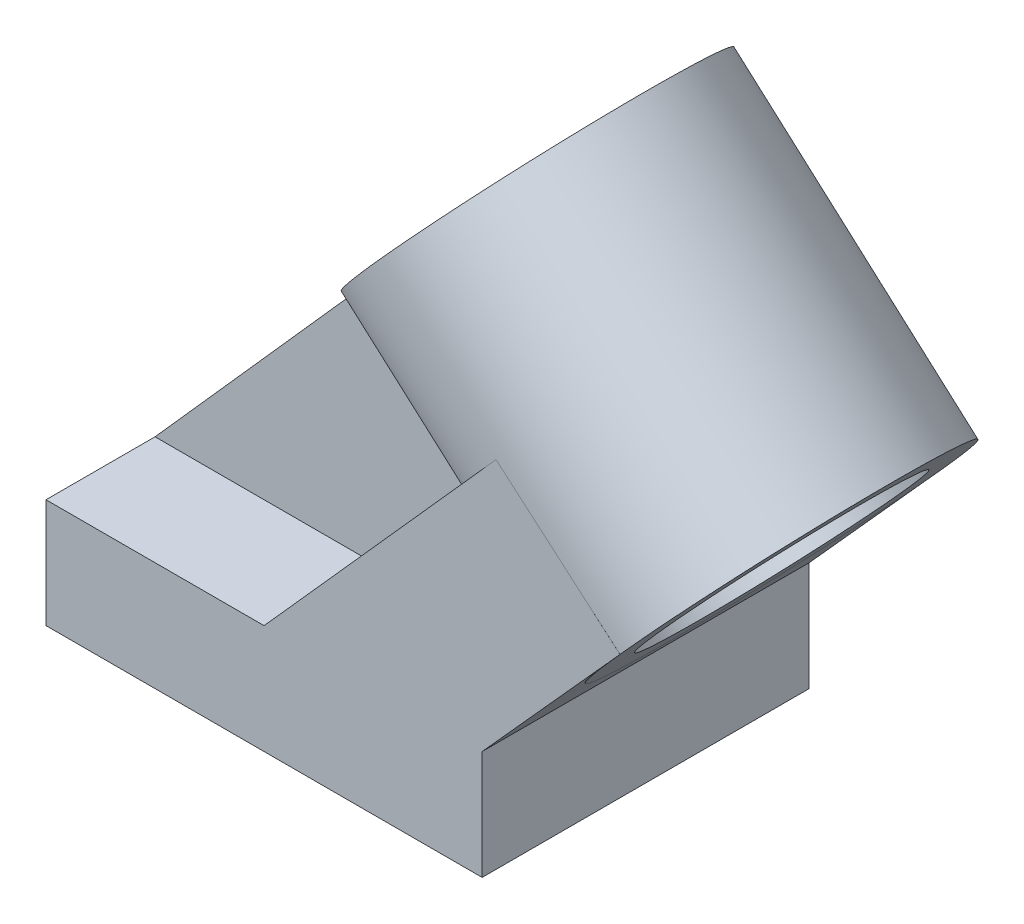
ISO-10303-21;
HEADER;
FILE_DESCRIPTION(('STEP AP214'),'2;1');
FILE_NAME('part.step','',(''),(''),'','','');
FILE_SCHEMA(('AUTOMOTIVE_DESIGN { 1 0 10303 214 1 1 1 1 }'));
ENDSEC;
DATA;
#1=APPLICATION_CONTEXT('core data for automotive mechanical design processes');
#2=APPLICATION_PROTOCOL_DEFINITION('international standard','automotive_design',2000,#1);
#3=PRODUCT_CONTEXT('',#1,'mechanical');
#4=PRODUCT('Part','Part','',(#3));
#5=PRODUCT_RELATED_PRODUCT_CATEGORY('part','',(#4));
#6=PRODUCT_DEFINITION_FORMATION('','',#4);
#7=PRODUCT_DEFINITION_CONTEXT('part definition',#1,'design');
#8=PRODUCT_DEFINITION('design','',#6,#7);
#9=PRODUCT_DEFINITION_SHAPE('','',#8);
#10=(LENGTH_UNIT() NAMED_UNIT(*) SI_UNIT(.MILLI.,.METRE.));
#11=(NAMED_UNIT(*) PLANE_ANGLE_UNIT() SI_UNIT($,.RADIAN.));
#12=(NAMED_UNIT(*) SI_UNIT($,.STERADIAN.) SOLID_ANGLE_UNIT());
#13=UNCERTAINTY_MEASURE_WITH_UNIT(LENGTH_MEASURE(1.E-05),#10,'distance_accuracy_value','');
#14=(GEOMETRIC_REPRESENTATION_CONTEXT(3) GLOBAL_UNCERTAINTY_ASSIGNED_CONTEXT((#13)) GLOBAL_UNIT_ASSIGNED_CONTEXT((#10,
#11,#12)) REPRESENTATION_CONTEXT('',''));
#15=CARTESIAN_POINT('',(0.,0.,0.));
#16=DIRECTION('',(0.,0.,1.));
#17=DIRECTION('',(1.,0.,0.));
#18=AXIS2_PLACEMENT_3D('',#15,#16,#17);
#19=CARTESIAN_POINT('',(-50.8,0.,76.2));
#20=DIRECTION('',(0.,-1.,0.));
#21=DIRECTION('',(0.,0.,-1.));
#22=AXIS2_PLACEMENT_3D('',#19,#20,#21);
#23=PLANE('',#22);
#24=DIRECTION('',(-1.,0.,0.));
#25=VECTOR('',#24,1.);
#26=CARTESIAN_POINT('',(-50.8,0.,25.4));
#27=LINE('',#26,#25);
#28=CARTESIAN_POINT('',(0.,0.,25.4));
#29=VERTEX_POINT('',#28);
#30=CARTESIAN_POINT('',(-50.8,0.,25.4));
#31=VERTEX_POINT('',#30);
#32=EDGE_CURVE('E129',#29,#31,#27,.T.);
#33=ORIENTED_EDGE('',*,*,#32,.F.);
#34=DIRECTION('',(0.,0.,1.));
#35=VECTOR('',#34,1.);
#36=CARTESIAN_POINT('',(0.,0.,0.));
#37=LINE('',#36,#35);
#38=CARTESIAN_POINT('',(0.,0.,0.));
#39=VERTEX_POINT('',#38);
#40=EDGE_CURVE('E206',#39,#29,#37,.T.);
#41=ORIENTED_EDGE('',*,*,#40,.F.);
#42=DIRECTION('',(-1.,0.,0.));
#43=VECTOR('',#42,1.);
#44=CARTESIAN_POINT('',(-50.8,0.,0.));
#45=LINE('',#44,#43);
#46=CARTESIAN_POINT('',(-50.8,0.,0.));
#47=VERTEX_POINT('',#46);
#48=EDGE_CURVE('E151',#39,#47,#45,.T.);
#49=ORIENTED_EDGE('',*,*,#48,.T.);
#50=DIRECTION('',(0.,0.,-1.));
#51=VECTOR('',#50,1.);
#52=CARTESIAN_POINT('',(-50.8,0.,76.2));
#53=LINE('',#52,#51);
#54=EDGE_CURVE('E149',#31,#47,#53,.T.);
#55=ORIENTED_EDGE('',*,*,#54,.F.);
#56=EDGE_LOOP('',(#33,#41,#49,#55));
#57=FACE_BOUND('',#56,.T.);
#58=ADVANCED_FACE('F33',(#57),#23,.F.);
#59=CARTESIAN_POINT('',(0.,0.,0.));
#60=DIRECTION('',(0.745935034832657,-0.666018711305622,0.));
#61=DIRECTION('',(0.666018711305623,0.745935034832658,0.));
#62=AXIS2_PLACEMENT_3D('',#59,#60,#61);
#63=PLANE('',#62);
#64=DIRECTION('',(-0.666018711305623,-0.745935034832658,0.));
#65=VECTOR('',#64,1.);
#66=CARTESIAN_POINT('',(0.,0.,25.4));
#67=LINE('',#66,#65);
#68=CARTESIAN_POINT('',(30.1166733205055,33.7304063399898,25.4));
#69=VERTEX_POINT('',#68);
#70=EDGE_CURVE('E132',#69,#29,#67,.T.);
#71=ORIENTED_EDGE('',*,*,#70,.F.);
#72=CARTESIAN_POINT('',(54.0407477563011,60.5251569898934,38.1));
#73=DIRECTION('',(0.745935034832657,-0.666018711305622,0.));
#74=DIRECTION('',(0.666018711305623,0.745935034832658,0.));
#75=AXIS2_PLACEMENT_3D('',#72,#73,#74);
#76=CIRCLE('',#75,38.1);
#77=CARTESIAN_POINT('',(54.0407477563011,60.5251569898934,0.));
#78=VERTEX_POINT('',#77);
#79=EDGE_CURVE('E185',#69,#78,#76,.T.);
#80=ORIENTED_EDGE('',*,*,#79,.T.);
#81=DIRECTION('',(0.666018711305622,0.745935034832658,0.));
#82=VECTOR('',#81,1.);
#83=CARTESIAN_POINT('',(0.,0.,0.));
#84=LINE('',#83,#82);
#85=EDGE_CURVE('E190',#39,#78,#84,.T.);
#86=ORIENTED_EDGE('',*,*,#85,.F.);
#87=ORIENTED_EDGE('',*,*,#40,.T.);
#88=EDGE_LOOP('',(#71,#80,#86,#87));
#89=FACE_BOUND('',#88,.T.);
#90=ADVANCED_FACE('F264',(#89),#63,.F.);
#91=CARTESIAN_POINT('',(54.0407477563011,60.5251569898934,0.));
#92=DIRECTION('',(-0.652720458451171,-0.75759884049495,0.));
#93=DIRECTION('',(0.75759884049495,-0.652720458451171,0.));
#94=AXIS2_PLACEMENT_3D('',#91,#92,#93);
#95=PLANE('',#94);
#96=DIRECTION('',(0.75759884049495,-0.652720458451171,0.));
#97=VECTOR('',#96,1.);
#98=CARTESIAN_POINT('',(54.0407477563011,60.5251569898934,0.));
#99=LINE('',#98,#97);
#100=CARTESIAN_POINT('',(82.9052635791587,35.6565075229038,0.));
#101=VERTEX_POINT('',#100);
#102=EDGE_CURVE('E186',#78,#101,#99,.T.);
#103=ORIENTED_EDGE('',*,*,#102,.F.);
#104=CARTESIAN_POINT('',(54.040747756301,60.5251569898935,38.1));
#105=DIRECTION('',(-0.652720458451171,-0.75759884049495,0.));
#106=DIRECTION('',(-0.75759884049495,0.652720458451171,0.));
#107=AXIS2_PLACEMENT_3D('',#104,#105,#106);
#108=ELLIPSE('',#107,2154.00934788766,38.1);
#109=CARTESIAN_POINT('',(82.9052635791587,35.6565075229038,0.00596051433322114));
#110=VERTEX_POINT('',#109);
#111=EDGE_CURVE('E180',#78,#110,#108,.T.);
#112=ORIENTED_EDGE('',*,*,#111,.T.);
#113=DIRECTION('',(0.,0.,1.));
#114=VECTOR('',#113,1.);
#115=CARTESIAN_POINT('',(82.9052635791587,35.6565075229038,0.));
#116=LINE('',#115,#114);
#117=EDGE_CURVE('E202',#101,#110,#116,.T.);
#118=ORIENTED_EDGE('',*,*,#117,.F.);
#119=EDGE_LOOP('',(#103,#112,#118));
#120=FACE_BOUND('',#119,.T.);
#121=ADVANCED_FACE('F265',(#120),#95,.F.);
#122=CARTESIAN_POINT('',(50.8,0.,0.));
#123=DIRECTION('',(0.743144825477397,-0.669130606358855,0.));
#124=DIRECTION('',(0.669130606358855,0.743144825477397,0.));
#125=AXIS2_PLACEMENT_3D('',#122,#123,#124);
#126=PLANE('',#125);
#127=CARTESIAN_POINT('',(82.4543253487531,35.1556898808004,38.1));
#128=DIRECTION('',(0.743144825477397,-0.669130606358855,0.));
#129=DIRECTION('',(-0.669130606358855,-0.743144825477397,0.));
#130=AXIS2_PLACEMENT_3D('',#127,#128,#129);
#131=ELLIPSE('',#130,38.100332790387,38.1);
#132=CARTESIAN_POINT('',(82.4543253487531,35.1556898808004,0.));
#133=VERTEX_POINT('',#132);
#134=EDGE_CURVE('E11',#133,#110,#131,.T.);
#135=ORIENTED_EDGE('',*,*,#134,.F.);
#136=DIRECTION('',(0.669130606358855,0.743144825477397,0.));
#137=VECTOR('',#136,1.);
#138=CARTESIAN_POINT('',(50.8,0.,0.));
#139=LINE('',#138,#137);
#140=EDGE_CURVE('E189',#133,#101,#139,.T.);
#141=ORIENTED_EDGE('',*,*,#140,.T.);
#142=ORIENTED_EDGE('',*,*,#117,.T.);
#143=EDGE_LOOP('',(#135,#141,#142));
#144=FACE_BOUND('',#143,.T.);
#145=ADVANCED_FACE('F256',(#144),#126,.T.);
#146=CARTESIAN_POINT('',(82.9052635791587,35.6565075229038,76.1940394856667));
#147=VERTEX_POINT('',#146);
#148=CARTESIAN_POINT('',(82.4543253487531,35.1556898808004,76.2));
#149=VERTEX_POINT('',#148);
#150=EDGE_CURVE('E43',#147,#149,#131,.T.);
#151=ORIENTED_EDGE('',*,*,#150,.F.);
#152=CARTESIAN_POINT('',(82.9052635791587,35.6565075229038,76.2));
#153=VERTEX_POINT('',#152);
#154=EDGE_CURVE('E209',#147,#153,#116,.T.);
#155=ORIENTED_EDGE('',*,*,#154,.T.);
#156=DIRECTION('',(0.669130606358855,0.743144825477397,0.));
#157=VECTOR('',#156,1.);
#158=CARTESIAN_POINT('',(50.8,0.,76.2));
#159=LINE('',#158,#157);
#160=EDGE_CURVE('E197',#149,#153,#159,.T.);
#161=ORIENTED_EDGE('',*,*,#160,.F.);
#162=EDGE_LOOP('',(#151,#155,#161));
#163=FACE_BOUND('',#162,.T.);
#164=ADVANCED_FACE('F318',(#163),#126,.T.);
#165=CARTESIAN_POINT('',(0.,0.,50.8));
#166=VERTEX_POINT('',#165);
#167=CARTESIAN_POINT('',(0.,0.,76.2));
#168=VERTEX_POINT('',#167);
#169=EDGE_CURVE('E37',#166,#168,#37,.T.);
#170=ORIENTED_EDGE('',*,*,#169,.F.);
#171=DIRECTION('',(-1.,0.,0.));
#172=VECTOR('',#171,1.);
#173=CARTESIAN_POINT('',(-50.8,0.,50.8));
#174=LINE('',#173,#172);
#175=CARTESIAN_POINT('',(-50.8,0.,50.8));
#176=VERTEX_POINT('',#175);
#177=EDGE_CURVE('E283',#166,#176,#174,.T.);
#178=ORIENTED_EDGE('',*,*,#177,.T.);
#179=CARTESIAN_POINT('',(-50.8,0.,76.2));
#180=VERTEX_POINT('',#179);
#181=EDGE_CURVE('E155',#180,#176,#53,.T.);
#182=ORIENTED_EDGE('',*,*,#181,.F.);
#183=DIRECTION('',(-1.,0.,0.));
#184=VECTOR('',#183,1.);
#185=CARTESIAN_POINT('',(-50.8,0.,76.2));
#186=LINE('',#185,#184);
#187=EDGE_CURVE('E156',#168,#180,#186,.T.);
#188=ORIENTED_EDGE('',*,*,#187,.F.);
#189=EDGE_LOOP('',(#170,#178,#182,#188));
#190=FACE_BOUND('',#189,.T.);
#191=ADVANCED_FACE('F282',(#190),#23,.F.);
#192=CARTESIAN_POINT('',(-50.8,-25.4,76.2));
#193=DIRECTION('',(1.,0.,0.));
#194=DIRECTION('',(0.,0.,-1.));
#195=AXIS2_PLACEMENT_3D('',#192,#193,#194);
#196=PLANE('',#195);
#197=ORIENTED_EDGE('',*,*,#181,.T.);
#198=DIRECTION('',(0.,0.,-1.));
#199=VECTOR('',#198,1.);
#200=CARTESIAN_POINT('',(-50.8,0.,76.2));
#201=LINE('',#200,#199);
#202=EDGE_CURVE('E142',#31,#176,#201,.F.);
#203=ORIENTED_EDGE('',*,*,#202,.F.);
#204=ORIENTED_EDGE('',*,*,#54,.T.);
#205=DIRECTION('',(0.,-1.,0.));
#206=VECTOR('',#205,1.);
#207=CARTESIAN_POINT('',(-50.8,-25.4,0.));
#208=LINE('',#207,#206);
#209=CARTESIAN_POINT('',(-50.8,-25.4,0.));
#210=VERTEX_POINT('',#209);
#211=EDGE_CURVE('E266',#47,#210,#208,.T.);
#212=ORIENTED_EDGE('',*,*,#211,.T.);
#213=DIRECTION('',(0.,0.,-1.));
#214=VECTOR('',#213,1.);
#215=CARTESIAN_POINT('',(-50.8,-25.4,76.2));
#216=LINE('',#215,#214);
#217=CARTESIAN_POINT('',(-50.8,-25.4,76.2));
#218=VERTEX_POINT('',#217);
#219=EDGE_CURVE('E219',#218,#210,#216,.T.);
#220=ORIENTED_EDGE('',*,*,#219,.F.);
#221=DIRECTION('',(0.,-1.,0.));
#222=VECTOR('',#221,1.);
#223=CARTESIAN_POINT('',(-50.8,-25.4,76.2));
#224=LINE('',#223,#222);
#225=EDGE_CURVE('E231',#180,#218,#224,.T.);
#226=ORIENTED_EDGE('',*,*,#225,.F.);
#227=EDGE_LOOP('',(#197,#203,#204,#212,#220,#226));
#228=FACE_BOUND('',#227,.T.);
#229=ADVANCED_FACE('F35',(#228),#196,.F.);
#230=CARTESIAN_POINT('',(50.8,-25.4,76.2));
#231=DIRECTION('',(0.,1.,0.));
#232=DIRECTION('',(-1.,0.,0.));
#233=AXIS2_PLACEMENT_3D('',#230,#231,#232);
#234=PLANE('',#233);
#235=ORIENTED_EDGE('',*,*,#219,.T.);
#236=DIRECTION('',(1.,0.,0.));
#237=VECTOR('',#236,1.);
#238=CARTESIAN_POINT('',(50.8,-25.4,0.));
#239=LINE('',#238,#237);
#240=CARTESIAN_POINT('',(50.8,-25.4,0.));
#241=VERTEX_POINT('',#240);
#242=EDGE_CURVE('E249',#210,#241,#239,.T.);
#243=ORIENTED_EDGE('',*,*,#242,.T.);
#244=DIRECTION('',(0.,0.,-1.));
#245=VECTOR('',#244,1.);
#246=CARTESIAN_POINT('',(50.8,-25.4,76.2));
#247=LINE('',#246,#245);
#248=CARTESIAN_POINT('',(50.8,-25.4,76.2));
#249=VERTEX_POINT('',#248);
#250=EDGE_CURVE('E221',#249,#241,#247,.T.);
#251=ORIENTED_EDGE('',*,*,#250,.F.);
#252=DIRECTION('',(1.,0.,0.));
#253=VECTOR('',#252,1.);
#254=CARTESIAN_POINT('',(50.8,-25.4,76.2));
#255=LINE('',#254,#253);
#256=EDGE_CURVE('E272',#218,#249,#255,.T.);
#257=ORIENTED_EDGE('',*,*,#256,.F.);
#258=EDGE_LOOP('',(#235,#243,#251,#257));
#259=FACE_BOUND('',#258,.T.);
#260=ADVANCED_FACE('F322',(#259),#234,.F.);
#261=CARTESIAN_POINT('',(50.8,0.,76.2));
#262=DIRECTION('',(-1.,0.,0.));
#263=DIRECTION('',(0.,0.,1.));
#264=AXIS2_PLACEMENT_3D('',#261,#262,#263);
#265=PLANE('',#264);
#266=ORIENTED_EDGE('',*,*,#250,.T.);
#267=DIRECTION('',(0.,1.,0.));
#268=VECTOR('',#267,1.);
#269=CARTESIAN_POINT('',(50.8,0.,0.));
#270=LINE('',#269,#268);
#271=CARTESIAN_POINT('',(50.8,0.,0.));
#272=VERTEX_POINT('',#271);
#273=EDGE_CURVE('E232',#241,#272,#270,.T.);
#274=ORIENTED_EDGE('',*,*,#273,.T.);
#275=DIRECTION('',(0.,0.,-1.));
#276=VECTOR('',#275,1.);
#277=CARTESIAN_POINT('',(50.8,0.,76.2));
#278=LINE('',#277,#276);
#279=CARTESIAN_POINT('',(50.8,0.,76.2));
#280=VERTEX_POINT('',#279);
#281=EDGE_CURVE('E227',#280,#272,#278,.T.);
#282=ORIENTED_EDGE('',*,*,#281,.F.);
#283=DIRECTION('',(0.,1.,0.));
#284=VECTOR('',#283,1.);
#285=CARTESIAN_POINT('',(50.8,0.,76.2));
#286=LINE('',#285,#284);
#287=EDGE_CURVE('E270',#249,#280,#286,.T.);
#288=ORIENTED_EDGE('',*,*,#287,.F.);
#289=EDGE_LOOP('',(#266,#274,#282,#288));
#290=FACE_BOUND('',#289,.T.);
#291=ADVANCED_FACE('F246',(#290),#265,.F.);
#292=CARTESIAN_POINT('',(0.,0.,76.2));
#293=DIRECTION('',(0.,0.,-1.));
#294=DIRECTION('',(-1.,0.,0.));
#295=AXIS2_PLACEMENT_3D('',#292,#293,#294);
#296=PLANE('',#295);
#297=EDGE_CURVE('E198',#280,#149,#159,.T.);
#298=ORIENTED_EDGE('',*,*,#297,.T.);
#299=ORIENTED_EDGE('',*,*,#160,.T.);
#300=DIRECTION('',(0.75759884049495,-0.652720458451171,0.));
#301=VECTOR('',#300,1.);
#302=CARTESIAN_POINT('',(54.0407477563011,60.5251569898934,76.2));
#303=LINE('',#302,#301);
#304=CARTESIAN_POINT('',(54.0407477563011,60.5251569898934,76.2));
#305=VERTEX_POINT('',#304);
#306=EDGE_CURVE('E194',#305,#153,#303,.T.);
#307=ORIENTED_EDGE('',*,*,#306,.F.);
#308=DIRECTION('',(0.666018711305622,0.745935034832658,0.));
#309=VECTOR('',#308,1.);
#310=CARTESIAN_POINT('',(0.,0.,76.2));
#311=LINE('',#310,#309);
#312=EDGE_CURVE('E184',#168,#305,#311,.T.);
#313=ORIENTED_EDGE('',*,*,#312,.F.);
#314=ORIENTED_EDGE('',*,*,#187,.T.);
#315=ORIENTED_EDGE('',*,*,#225,.T.);
#316=ORIENTED_EDGE('',*,*,#256,.T.);
#317=ORIENTED_EDGE('',*,*,#287,.T.);
#318=EDGE_LOOP('',(#298,#299,#307,#313,#314,#315,#316,#317));
#319=FACE_BOUND('',#318,.T.);
#320=ADVANCED_FACE('F275',(#319),#296,.F.);
#321=CARTESIAN_POINT('',(0.,0.,0.));
#322=DIRECTION('',(0.,0.,-1.));
#323=DIRECTION('',(-1.,0.,0.));
#324=AXIS2_PLACEMENT_3D('',#321,#322,#323);
#325=PLANE('',#324);
#326=ORIENTED_EDGE('',*,*,#85,.T.);
#327=ORIENTED_EDGE('',*,*,#102,.T.);
#328=ORIENTED_EDGE('',*,*,#140,.F.);
#329=EDGE_CURVE('E191',#272,#133,#139,.T.);
#330=ORIENTED_EDGE('',*,*,#329,.F.);
#331=ORIENTED_EDGE('',*,*,#273,.F.);
#332=ORIENTED_EDGE('',*,*,#242,.F.);
#333=ORIENTED_EDGE('',*,*,#211,.F.);
#334=ORIENTED_EDGE('',*,*,#48,.F.);
#335=EDGE_LOOP('',(#326,#327,#328,#330,#331,#332,#333,#334));
#336=FACE_BOUND('',#335,.T.);
#337=ADVANCED_FACE('F250',(#336),#325,.T.);
#338=CARTESIAN_POINT('',(30.1166733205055,33.7304063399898,50.8));
#339=VERTEX_POINT('',#338);
#340=EDGE_CURVE('E181',#305,#339,#76,.T.);
#341=ORIENTED_EDGE('',*,*,#340,.T.);
#342=DIRECTION('',(-0.666018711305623,-0.745935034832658,0.));
#343=VECTOR('',#342,1.);
#344=CARTESIAN_POINT('',(0.,0.,50.8));
#345=LINE('',#344,#343);
#346=EDGE_CURVE('E286',#339,#166,#345,.T.);
#347=ORIENTED_EDGE('',*,*,#346,.T.);
#348=ORIENTED_EDGE('',*,*,#169,.T.);
#349=ORIENTED_EDGE('',*,*,#312,.T.);
#350=EDGE_LOOP('',(#341,#347,#348,#349));
#351=FACE_BOUND('',#350,.T.);
#352=ADVANCED_FACE('F297',(#351),#63,.F.);
#353=ORIENTED_EDGE('',*,*,#154,.F.);
#354=EDGE_CURVE('E178',#147,#305,#108,.T.);
#355=ORIENTED_EDGE('',*,*,#354,.T.);
#356=ORIENTED_EDGE('',*,*,#306,.T.);
#357=EDGE_LOOP('',(#353,#355,#356));
#358=FACE_BOUND('',#357,.T.);
#359=ADVANCED_FACE('F331',(#358),#95,.F.);
#360=ORIENTED_EDGE('',*,*,#281,.T.);
#361=ORIENTED_EDGE('',*,*,#329,.T.);
#362=EDGE_CURVE('E44',#149,#133,#131,.T.);
#363=ORIENTED_EDGE('',*,*,#362,.F.);
#364=ORIENTED_EDGE('',*,*,#297,.F.);
#365=EDGE_LOOP('',(#360,#361,#363,#364));
#366=FACE_BOUND('',#365,.T.);
#367=ADVANCED_FACE('F240',(#366),#126,.T.);
#368=CARTESIAN_POINT('',(82.4608725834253,35.1498440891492,38.1));
#369=DIRECTION('',(-0.745935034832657,0.666018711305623,0.));
#370=DIRECTION('',(-0.666018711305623,-0.745935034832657,0.));
#371=AXIS2_PLACEMENT_3D('',#368,#369,#370);
#372=CYLINDRICAL_SURFACE('',#371,38.1);
#373=CARTESIAN_POINT('',(82.4608725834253,35.1498440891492,38.1));
#374=DIRECTION('',(-0.745935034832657,0.666018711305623,0.));
#375=DIRECTION('',(-0.666018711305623,-0.745935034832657,0.));
#376=AXIS2_PLACEMENT_3D('',#373,#374,#375);
#377=CIRCLE('',#376,38.1);
#378=CARTESIAN_POINT('',(57.0855596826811,6.72971926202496,38.1));
#379=VERTEX_POINT('',#378);
#380=EDGE_CURVE('E175',#379,#379,#377,.T.);
#381=ORIENTED_EDGE('',*,*,#380,.T.);
#382=EDGE_LOOP('',(#381));
#383=FACE_BOUND('',#382,.T.);
#384=ORIENTED_EDGE('',*,*,#362,.T.);
#385=ORIENTED_EDGE('',*,*,#134,.T.);
#386=ORIENTED_EDGE('',*,*,#111,.F.);
#387=ORIENTED_EDGE('',*,*,#79,.F.);
#388=DIRECTION('',(-0.745935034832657,0.666018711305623,0.));
#389=VECTOR('',#388,1.);
#390=CARTESIAN_POINT('',(58.5367981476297,8.35509343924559,25.4));
#391=LINE('',#390,#389);
#392=CARTESIAN_POINT('',(1.7116661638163,59.0922212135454,25.4));
#393=VERTEX_POINT('',#392);
#394=EDGE_CURVE('E287',#69,#393,#391,.T.);
#395=ORIENTED_EDGE('',*,*,#394,.T.);
#396=CARTESIAN_POINT('',(25.5726171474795,85.9433325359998,38.1));
#397=DIRECTION('',(0.747501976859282,-0.664259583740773,0.));
#398=DIRECTION('',(0.664259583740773,0.747501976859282,0.));
#399=AXIS2_PLACEMENT_3D('',#396,#397,#398);
#400=ELLIPSE('',#399,38.1001057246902,38.1);
#401=CARTESIAN_POINT('',(1.7116661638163,59.0922212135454,50.8));
#402=VERTEX_POINT('',#401);
#403=EDGE_CURVE('E145',#402,#393,#400,.T.);
#404=ORIENTED_EDGE('',*,*,#403,.F.);
#405=DIRECTION('',(-0.745935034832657,0.666018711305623,0.));
#406=VECTOR('',#405,1.);
#407=CARTESIAN_POINT('',(58.5367981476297,8.3550934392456,50.8));
#408=LINE('',#407,#406);
#409=EDGE_CURVE('E166',#339,#402,#408,.T.);
#410=ORIENTED_EDGE('',*,*,#409,.F.);
#411=ORIENTED_EDGE('',*,*,#340,.F.);
#412=ORIENTED_EDGE('',*,*,#354,.F.);
#413=ORIENTED_EDGE('',*,*,#150,.T.);
#414=EDGE_LOOP('',(#384,#385,#386,#387,#395,#404,#410,#411,#412,#413));
#415=FACE_BOUND('',#414,.T.);
#416=CARTESIAN_POINT('',(25.6206229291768,85.9004698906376,38.1));
#417=DIRECTION('',(-0.745935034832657,0.666018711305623,0.));
#418=DIRECTION('',(-0.666018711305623,-0.745935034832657,0.));
#419=AXIS2_PLACEMENT_3D('',#416,#417,#418);
#420=CIRCLE('',#419,38.1);
#421=CARTESIAN_POINT('',(0.245310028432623,57.4803450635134,38.1));
#422=VERTEX_POINT('',#421);
#423=EDGE_CURVE('E164',#422,#422,#420,.T.);
#424=ORIENTED_EDGE('',*,*,#423,.F.);
#425=EDGE_LOOP('',(#424));
#426=FACE_BOUND('',#425,.T.);
#427=ADVANCED_FACE('F258',(#383,#415,#426),#372,.T.);
#428=CARTESIAN_POINT('',(82.4608725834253,35.1498440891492,38.1));
#429=DIRECTION('',(-0.745935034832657,0.666018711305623,0.));
#430=DIRECTION('',(-0.666018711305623,-0.745935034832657,0.));
#431=AXIS2_PLACEMENT_3D('',#428,#429,#430);
#432=CYLINDRICAL_SURFACE('',#431,28.575);
#433=CARTESIAN_POINT('',(82.4608725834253,35.1498440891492,38.1));
#434=DIRECTION('',(-0.745935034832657,0.666018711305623,0.));
#435=DIRECTION('',(-0.666018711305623,-0.745935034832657,0.));
#436=AXIS2_PLACEMENT_3D('',#433,#434,#435);
#437=CIRCLE('',#436,28.575);
#438=CARTESIAN_POINT('',(63.4293879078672,13.834750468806,38.1));
#439=VERTEX_POINT('',#438);
#440=EDGE_CURVE('E172',#439,#439,#437,.T.);
#441=ORIENTED_EDGE('',*,*,#440,.F.);
#442=EDGE_LOOP('',(#441));
#443=FACE_BOUND('',#442,.T.);
#444=CARTESIAN_POINT('',(25.6206229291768,85.9004698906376,38.1));
#445=DIRECTION('',(-0.745935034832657,0.666018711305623,0.));
#446=DIRECTION('',(-0.666018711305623,-0.745935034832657,0.));
#447=AXIS2_PLACEMENT_3D('',#444,#445,#446);
#448=CIRCLE('',#447,28.575);
#449=CARTESIAN_POINT('',(6.58913825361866,64.5853762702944,38.1));
#450=VERTEX_POINT('',#449);
#451=EDGE_CURVE('E161',#450,#450,#448,.T.);
#452=ORIENTED_EDGE('',*,*,#451,.T.);
#453=EDGE_LOOP('',(#452));
#454=FACE_BOUND('',#453,.T.);
#455=ADVANCED_FACE('F336',(#443,#454),#432,.F.);
#456=CARTESIAN_POINT('',(82.4608725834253,35.1498440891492,38.1));
#457=DIRECTION('',(-0.745935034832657,0.666018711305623,0.));
#458=DIRECTION('',(-0.666018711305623,-0.745935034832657,0.));
#459=AXIS2_PLACEMENT_3D('',#456,#457,#458);
#460=PLANE('',#459);
#461=ORIENTED_EDGE('',*,*,#440,.T.);
#462=EDGE_LOOP('',(#461));
#463=FACE_BOUND('',#462,.T.);
#464=ORIENTED_EDGE('',*,*,#380,.F.);
#465=EDGE_LOOP('',(#464));
#466=FACE_BOUND('',#465,.T.);
#467=ADVANCED_FACE('F399',(#463,#466),#460,.F.);
#468=CARTESIAN_POINT('',(25.6206229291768,85.9004698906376,38.1));
#469=DIRECTION('',(-0.745935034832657,0.666018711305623,0.));
#470=DIRECTION('',(-0.666018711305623,-0.745935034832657,0.));
#471=AXIS2_PLACEMENT_3D('',#468,#469,#470);
#472=PLANE('',#471);
#473=ORIENTED_EDGE('',*,*,#451,.F.);
#474=EDGE_LOOP('',(#473));
#475=FACE_BOUND('',#474,.T.);
#476=ORIENTED_EDGE('',*,*,#423,.T.);
#477=EDGE_LOOP('',(#476));
#478=FACE_BOUND('',#477,.T.);
#479=ADVANCED_FACE('F306',(#475,#478),#472,.T.);
#480=CARTESIAN_POINT('',(-50.8,0.,38.1));
#481=DIRECTION('',(0.747501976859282,-0.664259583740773,0.));
#482=DIRECTION('',(0.664259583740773,0.747501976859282,0.));
#483=AXIS2_PLACEMENT_3D('',#480,#481,#482);
#484=PLANE('',#483);
#485=DIRECTION('',(0.664259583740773,0.747501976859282,0.));
#486=VECTOR('',#485,1.);
#487=CARTESIAN_POINT('',(-50.8,0.,25.4));
#488=LINE('',#487,#486);
#489=EDGE_CURVE('E51',#31,#393,#488,.T.);
#490=ORIENTED_EDGE('',*,*,#489,.F.);
#491=ORIENTED_EDGE('',*,*,#202,.T.);
#492=DIRECTION('',(0.664259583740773,0.747501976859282,0.));
#493=VECTOR('',#492,1.);
#494=CARTESIAN_POINT('',(-50.8,0.,50.8));
#495=LINE('',#494,#493);
#496=EDGE_CURVE('E136',#176,#402,#495,.T.);
#497=ORIENTED_EDGE('',*,*,#496,.T.);
#498=ORIENTED_EDGE('',*,*,#403,.T.);
#499=EDGE_LOOP('',(#490,#491,#497,#498));
#500=FACE_BOUND('',#499,.T.);
#501=ADVANCED_FACE('F139',(#500),#484,.F.);
#502=CARTESIAN_POINT('',(28.5180802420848,44.4602973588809,50.8));
#503=DIRECTION('',(0.,0.,1.));
#504=DIRECTION('',(1.,0.,0.));
#505=AXIS2_PLACEMENT_3D('',#502,#503,#504);
#506=PLANE('',#505);
#507=ORIENTED_EDGE('',*,*,#346,.F.);
#508=ORIENTED_EDGE('',*,*,#409,.T.);
#509=ORIENTED_EDGE('',*,*,#496,.F.);
#510=ORIENTED_EDGE('',*,*,#177,.F.);
#511=EDGE_LOOP('',(#507,#508,#509,#510));
#512=FACE_BOUND('',#511,.T.);
#513=ADVANCED_FACE('F298',(#512),#506,.T.);
#514=CARTESIAN_POINT('',(28.5180802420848,44.4602973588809,25.4));
#515=DIRECTION('',(0.,0.,1.));
#516=DIRECTION('',(1.,0.,0.));
#517=AXIS2_PLACEMENT_3D('',#514,#515,#516);
#518=PLANE('',#517);
#519=ORIENTED_EDGE('',*,*,#394,.F.);
#520=ORIENTED_EDGE('',*,*,#70,.T.);
#521=ORIENTED_EDGE('',*,*,#32,.T.);
#522=ORIENTED_EDGE('',*,*,#489,.T.);
#523=EDGE_LOOP('',(#519,#520,#521,#522));
#524=FACE_BOUND('',#523,.T.);
#525=ADVANCED_FACE('F130',(#524),#518,.F.);
#526=CLOSED_SHELL('',(#58,#90,#121,#145,#164,#191,#229,#260,#291,#320,#337,#352,#359,#367,#427,
#455,#467,#479,#501,#513,#525));
#527=MANIFOLD_SOLID_BREP('B2',#526);
#528=ADVANCED_BREP_SHAPE_REPRESENTATION('',(#18,#527),#14);
#529=SHAPE_DEFINITION_REPRESENTATION(#9,#528);
ENDSEC;
END-ISO-10303-21;
